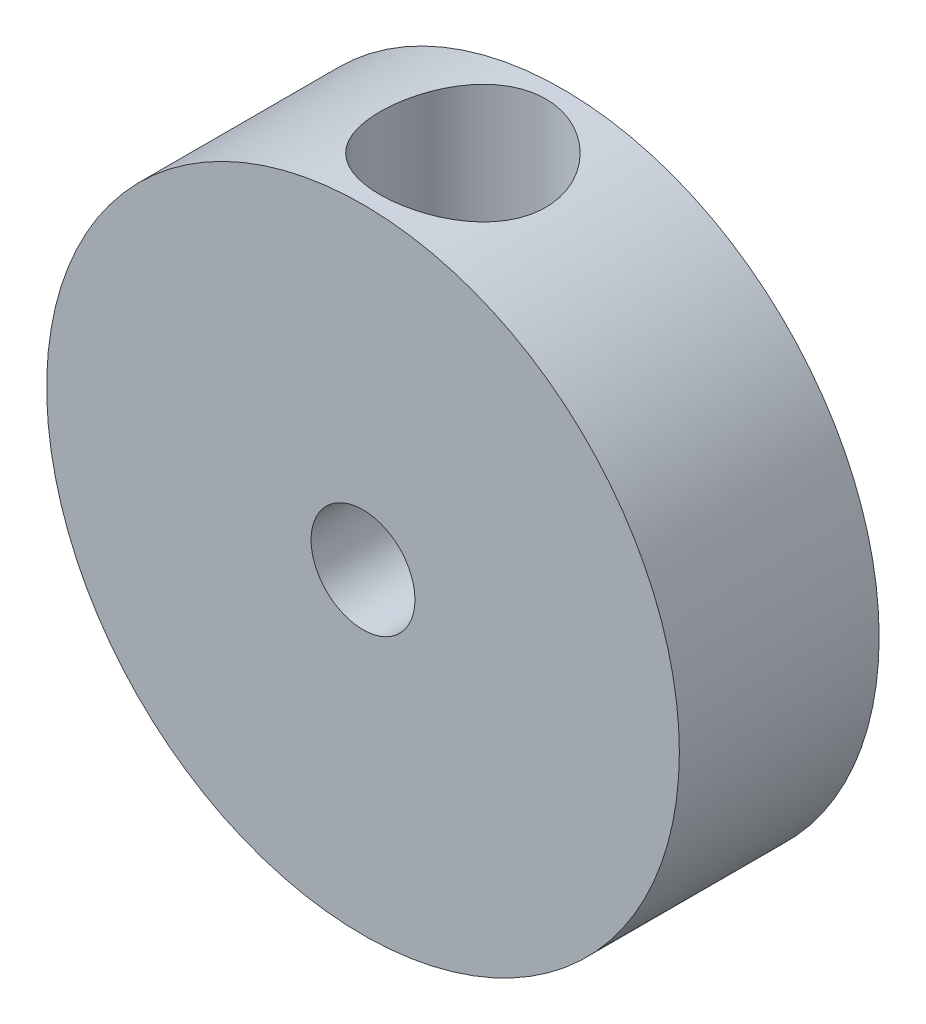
ISO-10303-21;
HEADER;
FILE_DESCRIPTION(('STEP AP214'),'2;1');
FILE_NAME('part.step','',(''),(''),'','','');
FILE_SCHEMA(('AUTOMOTIVE_DESIGN { 1 0 10303 214 1 1 1 1 }'));
ENDSEC;
DATA;
#1=APPLICATION_CONTEXT('core data for automotive mechanical design processes');
#2=APPLICATION_PROTOCOL_DEFINITION('international standard','automotive_design',2000,#1);
#3=PRODUCT_CONTEXT('',#1,'mechanical');
#4=PRODUCT('Part','Part','',(#3));
#5=PRODUCT_RELATED_PRODUCT_CATEGORY('part','',(#4));
#6=PRODUCT_DEFINITION_FORMATION('','',#4);
#7=PRODUCT_DEFINITION_CONTEXT('part definition',#1,'design');
#8=PRODUCT_DEFINITION('design','',#6,#7);
#9=PRODUCT_DEFINITION_SHAPE('','',#8);
#10=(LENGTH_UNIT() NAMED_UNIT(*) SI_UNIT(.MILLI.,.METRE.));
#11=(NAMED_UNIT(*) PLANE_ANGLE_UNIT() SI_UNIT($,.RADIAN.));
#12=(NAMED_UNIT(*) SI_UNIT($,.STERADIAN.) SOLID_ANGLE_UNIT());
#13=UNCERTAINTY_MEASURE_WITH_UNIT(LENGTH_MEASURE(1.E-05),#10,'distance_accuracy_value','');
#14=(GEOMETRIC_REPRESENTATION_CONTEXT(3) GLOBAL_UNCERTAINTY_ASSIGNED_CONTEXT((#13)) GLOBAL_UNIT_ASSIGNED_CONTEXT((#10,
#11,#12)) REPRESENTATION_CONTEXT('',''));
#15=CARTESIAN_POINT('',(0.,0.,0.));
#16=DIRECTION('',(0.,0.,1.));
#17=DIRECTION('',(1.,0.,0.));
#18=AXIS2_PLACEMENT_3D('',#15,#16,#17);
#19=CARTESIAN_POINT('',(0.,0.,-7.62));
#20=DIRECTION('',(0.,0.,1.));
#21=DIRECTION('',(1.,0.,0.));
#22=AXIS2_PLACEMENT_3D('',#19,#20,#21);
#23=CYLINDRICAL_SURFACE('',#22,12.065);
#24=CARTESIAN_POINT('',(0.,-12.065,-0.6477));
#25=CARTESIAN_POINT('',(-0.174438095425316,-12.0649972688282,-0.647704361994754));
#26=CARTESIAN_POINT('',(-0.348923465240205,-12.0611795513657,-0.662181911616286));
#27=CARTESIAN_POINT('',(-0.692874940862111,-12.0463204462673,-0.71961151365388));
#28=CARTESIAN_POINT('',(-0.862338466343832,-12.0352754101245,-0.762577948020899));
#29=CARTESIAN_POINT('',(-1.19123115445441,-12.007181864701,-0.875497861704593));
#30=CARTESIAN_POINT('',(-1.35067271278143,-11.9901409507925,-0.945417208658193));
#31=CARTESIAN_POINT('',(-1.65556558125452,-11.9518604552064,-1.11013344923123));
#32=CARTESIAN_POINT('',(-1.80101608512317,-11.9306206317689,-1.20493177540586));
#33=CARTESIAN_POINT('',(-2.07706563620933,-11.8857055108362,-1.41896379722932));
#34=CARTESIAN_POINT('',(-2.20730557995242,-11.8619897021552,-1.53865216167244));
#35=CARTESIAN_POINT('',(-2.44611306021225,-11.8150581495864,-1.79809438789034));
#36=CARTESIAN_POINT('',(-2.55467790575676,-11.7918424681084,-1.93785073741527));
#37=CARTESIAN_POINT('',(-2.74878696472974,-11.7481270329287,-2.23630629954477));
#38=CARTESIAN_POINT('',(-2.83392125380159,-11.7276784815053,-2.39528030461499));
#39=CARTESIAN_POINT('',(-2.97611339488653,-11.6924068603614,-2.72590746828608));
#40=CARTESIAN_POINT('',(-3.03317622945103,-11.6775827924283,-2.89755837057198));
#41=CARTESIAN_POINT('',(-3.1163646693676,-11.655656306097,-3.24469755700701));
#42=CARTESIAN_POINT('',(-3.14313985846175,-11.6483920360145,-3.42001970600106));
#43=CARTESIAN_POINT('',(-3.16701763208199,-11.6419238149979,-3.77280631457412));
#44=CARTESIAN_POINT('',(-3.16412555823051,-11.6427184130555,-3.95027038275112));
#45=CARTESIAN_POINT('',(-3.12926732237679,-11.6521331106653,-4.29725896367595));
#46=CARTESIAN_POINT('',(-3.09808379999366,-11.6605425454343,-4.46686872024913));
#47=CARTESIAN_POINT('',(-3.00877994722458,-11.6839025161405,-4.79836084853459));
#48=CARTESIAN_POINT('',(-2.95065752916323,-11.6988535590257,-4.96024262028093));
#49=CARTESIAN_POINT('',(-2.80847990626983,-11.7337996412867,-5.27373993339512));
#50=CARTESIAN_POINT('',(-2.7241476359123,-11.7538481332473,-5.42522361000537));
#51=CARTESIAN_POINT('',(-2.53213761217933,-11.7967010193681,-5.71216612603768));
#52=CARTESIAN_POINT('',(-2.42445540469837,-11.8195059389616,-5.84762190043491));
#53=CARTESIAN_POINT('',(-2.1847858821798,-11.866181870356,-6.10313888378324));
#54=CARTESIAN_POINT('',(-2.05214043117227,-11.8900638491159,-6.22258161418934));
#55=CARTESIAN_POINT('',(-1.76841151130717,-11.9355585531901,-6.43765131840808));
#56=CARTESIAN_POINT('',(-1.61732736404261,-11.9571711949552,-6.5332774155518));
#57=CARTESIAN_POINT('',(-1.30007310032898,-11.9958176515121,-6.69825892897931));
#58=CARTESIAN_POINT('',(-1.13384398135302,-12.0128324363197,-6.76750563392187));
#59=CARTESIAN_POINT('',(-0.791556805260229,-12.0402283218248,-6.87689450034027));
#60=CARTESIAN_POINT('',(-0.615500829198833,-12.0506108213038,-6.91704279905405));
#61=CARTESIAN_POINT('',(-0.263838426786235,-12.0633620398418,-6.96613153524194));
#62=CARTESIAN_POINT('',(-0.0883570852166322,-12.0659467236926,-6.97591322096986));
#63=CARTESIAN_POINT('',(0.26173764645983,-12.0634303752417,-6.96630983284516));
#64=CARTESIAN_POINT('',(0.436351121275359,-12.0583301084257,-6.94692766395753));
#65=CARTESIAN_POINT('',(0.776773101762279,-12.0411561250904,-6.88023777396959));
#66=CARTESIAN_POINT('',(0.942679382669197,-12.0291989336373,-6.83339639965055));
#67=CARTESIAN_POINT('',(1.26426541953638,-11.9996648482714,-6.71365681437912));
#68=CARTESIAN_POINT('',(1.41994408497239,-11.9820873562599,-6.64075583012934));
#69=CARTESIAN_POINT('',(1.71994646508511,-11.9427532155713,-6.46938654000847));
#70=CARTESIAN_POINT('',(1.86399673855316,-11.9209232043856,-6.37045679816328));
#71=CARTESIAN_POINT('',(2.13374783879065,-11.8756088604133,-6.15042102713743));
#72=CARTESIAN_POINT('',(2.25944516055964,-11.8521242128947,-6.02931077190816));
#73=CARTESIAN_POINT('',(2.49244553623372,-11.8053576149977,-5.76443118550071));
#74=CARTESIAN_POINT('',(2.59915594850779,-11.7820985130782,-5.62013556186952));
#75=CARTESIAN_POINT('',(2.7868570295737,-11.7391209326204,-5.31519690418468));
#76=CARTESIAN_POINT('',(2.8678487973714,-11.7194023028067,-5.15455456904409));
#77=CARTESIAN_POINT('',(3.00120392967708,-11.6859628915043,-4.82230488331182));
#78=CARTESIAN_POINT('',(3.05373474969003,-11.6722071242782,-4.65076845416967));
#79=CARTESIAN_POINT('',(3.12908699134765,-11.6522353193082,-4.30087732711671));
#80=CARTESIAN_POINT('',(3.1519156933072,-11.6460174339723,-4.12252431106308));
#81=CARTESIAN_POINT('',(3.16680743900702,-11.6419760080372,-3.7701197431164));
#82=CARTESIAN_POINT('',(3.15982147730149,-11.643892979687,-3.59611074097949));
#83=CARTESIAN_POINT('',(3.11747993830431,-11.6552998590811,-3.25184515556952));
#84=CARTESIAN_POINT('',(3.08212504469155,-11.6647895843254,-3.08158848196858));
#85=CARTESIAN_POINT('',(2.98459185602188,-11.6901209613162,-2.75081183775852));
#86=CARTESIAN_POINT('',(2.92260861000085,-11.7059163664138,-2.59023056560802));
#87=CARTESIAN_POINT('',(2.77373027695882,-11.7420819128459,-2.2816267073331));
#88=CARTESIAN_POINT('',(2.68683140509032,-11.7624527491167,-2.13360603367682));
#89=CARTESIAN_POINT('',(2.4876787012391,-11.8061991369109,-1.84976998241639));
#90=CARTESIAN_POINT('',(2.37477283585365,-11.8296437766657,-1.7144226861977));
#91=CARTESIAN_POINT('',(2.12805975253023,-11.8765030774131,-1.46428652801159));
#92=CARTESIAN_POINT('',(1.99424749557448,-11.8999177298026,-1.34950263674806));
#93=CARTESIAN_POINT('',(1.70621711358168,-11.9446512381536,-1.14144875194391));
#94=CARTESIAN_POINT('',(1.55163759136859,-11.9659174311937,-1.04866682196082));
#95=CARTESIAN_POINT('',(1.22852509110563,-12.0033878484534,-0.890553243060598));
#96=CARTESIAN_POINT('',(1.06000145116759,-12.0195954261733,-0.825203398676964));
#97=CARTESIAN_POINT('',(0.743341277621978,-12.0429419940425,-0.732664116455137));
#98=CARTESIAN_POINT('',(0.596611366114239,-12.0511544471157,-0.700875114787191));
#99=CARTESIAN_POINT('',(0.299932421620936,-12.0621843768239,-0.658392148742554));
#100=CARTESIAN_POINT('',(0.149983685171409,-12.0650023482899,-0.647696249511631));
#101=CARTESIAN_POINT('',(0.,-12.065,-0.6477));
#102=B_SPLINE_CURVE_WITH_KNOTS('',3,(#24,#25,#26,#27,#28,#29,#30,#31,#32,#33,#34,#35,#36,#37,
#38,#39,#40,#41,#42,#43,#44,#45,#46,#47,#48,#49,#50,#51,#52,#53,#54,#55,#56,#57,#58,#59,#60,#61,
#62,#63,#64,#65,#66,#67,#68,#69,#70,#71,#72,#73,#74,#75,#76,#77,#78,#79,#80,#81,#82,#83,#84,#85,
#86,#87,#88,#89,#90,#91,#92,#93,#94,#95,#96,#97,#98,#99,#100,#101),.UNSPECIFIED.,.T.,.F.,(4,2,2,
2,2,2,2,2,2,2,2,2,2,2,2,2,2,2,2,2,2,2,2,2,2,2,2,2,2,2,2,2,2,2,2,2,2,2,4),(0.,0.52276436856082,
1.04579284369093,1.56816113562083,2.09055951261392,2.62350414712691,3.15651490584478,
3.69833090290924,4.24005069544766,4.76991775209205,5.29968940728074,5.81523822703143,
6.33082700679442,6.85206295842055,7.37339842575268,7.91113730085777,8.44889596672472,
8.98884739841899,9.52868491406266,10.0534274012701,10.5781176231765,11.0941449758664,
11.6102272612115,12.1361598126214,12.6621926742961,13.2025194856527,13.7428232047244,
14.2799124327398,14.8168699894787,15.3368304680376,15.8567784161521,16.3729810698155,
16.8892621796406,17.4202573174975,17.9513806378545,18.4933674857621,19.034994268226,
19.4845137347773,19.9339919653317),.UNSPECIFIED.);
#103=CARTESIAN_POINT('',(0.,-12.065,-0.6477));
#104=VERTEX_POINT('',#103);
#105=EDGE_CURVE('E50',#104,#104,#102,.T.);
#106=ORIENTED_EDGE('',*,*,#105,.F.);
#107=EDGE_LOOP('',(#106));
#108=FACE_BOUND('',#107,.T.);
#109=CARTESIAN_POINT('',(0.,12.065,-0.6477));
#110=CARTESIAN_POINT('',(0.174438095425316,12.0649972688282,-0.647704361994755));
#111=CARTESIAN_POINT('',(0.348923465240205,12.0611795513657,-0.662181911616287));
#112=CARTESIAN_POINT('',(0.692874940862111,12.0463204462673,-0.719611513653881));
#113=CARTESIAN_POINT('',(0.862338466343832,12.0352754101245,-0.762577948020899));
#114=CARTESIAN_POINT('',(1.19123115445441,12.007181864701,-0.875497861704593));
#115=CARTESIAN_POINT('',(1.35067271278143,11.9901409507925,-0.945417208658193));
#116=CARTESIAN_POINT('',(1.65556558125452,11.9518604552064,-1.11013344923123));
#117=CARTESIAN_POINT('',(1.80101608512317,11.9306206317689,-1.20493177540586));
#118=CARTESIAN_POINT('',(2.07706563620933,11.8857055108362,-1.41896379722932));
#119=CARTESIAN_POINT('',(2.20730557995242,11.8619897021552,-1.53865216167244));
#120=CARTESIAN_POINT('',(2.44611306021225,11.8150581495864,-1.79809438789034));
#121=CARTESIAN_POINT('',(2.55467790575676,11.7918424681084,-1.93785073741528));
#122=CARTESIAN_POINT('',(2.74878696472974,11.7481270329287,-2.23630629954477));
#123=CARTESIAN_POINT('',(2.83392125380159,11.7276784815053,-2.39528030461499));
#124=CARTESIAN_POINT('',(2.97611339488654,11.6924068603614,-2.72590746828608));
#125=CARTESIAN_POINT('',(3.03317622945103,11.6775827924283,-2.89755837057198));
#126=CARTESIAN_POINT('',(3.1163646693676,11.655656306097,-3.24469755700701));
#127=CARTESIAN_POINT('',(3.14313985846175,11.6483920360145,-3.42001970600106));
#128=CARTESIAN_POINT('',(3.16701763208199,11.6419238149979,-3.77280631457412));
#129=CARTESIAN_POINT('',(3.16412555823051,11.6427184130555,-3.95027038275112));
#130=CARTESIAN_POINT('',(3.12926732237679,11.6521331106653,-4.29725896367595));
#131=CARTESIAN_POINT('',(3.09808379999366,11.6605425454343,-4.46686872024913));
#132=CARTESIAN_POINT('',(3.00877994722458,11.6839025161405,-4.79836084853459));
#133=CARTESIAN_POINT('',(2.95065752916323,11.6988535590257,-4.96024262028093));
#134=CARTESIAN_POINT('',(2.80847990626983,11.7337996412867,-5.27373993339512));
#135=CARTESIAN_POINT('',(2.7241476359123,11.7538481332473,-5.42522361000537));
#136=CARTESIAN_POINT('',(2.53213761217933,11.7967010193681,-5.71216612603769));
#137=CARTESIAN_POINT('',(2.42445540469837,11.8195059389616,-5.84762190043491));
#138=CARTESIAN_POINT('',(2.1847858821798,11.866181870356,-6.10313888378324));
#139=CARTESIAN_POINT('',(2.05214043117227,11.8900638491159,-6.22258161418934));
#140=CARTESIAN_POINT('',(1.76841151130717,11.9355585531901,-6.43765131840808));
#141=CARTESIAN_POINT('',(1.61732736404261,11.9571711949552,-6.5332774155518));
#142=CARTESIAN_POINT('',(1.30007310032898,11.9958176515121,-6.69825892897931));
#143=CARTESIAN_POINT('',(1.13384398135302,12.0128324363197,-6.76750563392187));
#144=CARTESIAN_POINT('',(0.791556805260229,12.0402283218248,-6.87689450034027));
#145=CARTESIAN_POINT('',(0.615500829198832,12.0506108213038,-6.91704279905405));
#146=CARTESIAN_POINT('',(0.263838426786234,12.0633620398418,-6.96613153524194));
#147=CARTESIAN_POINT('',(0.0883570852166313,12.0659467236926,-6.97591322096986));
#148=CARTESIAN_POINT('',(-0.261737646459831,12.0634303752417,-6.96630983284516));
#149=CARTESIAN_POINT('',(-0.436351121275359,12.0583301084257,-6.94692766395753));
#150=CARTESIAN_POINT('',(-0.776773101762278,12.0411561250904,-6.88023777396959));
#151=CARTESIAN_POINT('',(-0.942679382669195,12.0291989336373,-6.83339639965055));
#152=CARTESIAN_POINT('',(-1.26426541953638,11.9996648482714,-6.71365681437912));
#153=CARTESIAN_POINT('',(-1.41994408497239,11.9820873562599,-6.64075583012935));
#154=CARTESIAN_POINT('',(-1.71994646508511,11.9427532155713,-6.46938654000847));
#155=CARTESIAN_POINT('',(-1.86399673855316,11.9209232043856,-6.37045679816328));
#156=CARTESIAN_POINT('',(-2.13374783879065,11.8756088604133,-6.15042102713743));
#157=CARTESIAN_POINT('',(-2.25944516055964,11.8521242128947,-6.02931077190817));
#158=CARTESIAN_POINT('',(-2.49244553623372,11.8053576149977,-5.76443118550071));
#159=CARTESIAN_POINT('',(-2.59915594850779,11.7820985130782,-5.62013556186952));
#160=CARTESIAN_POINT('',(-2.7868570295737,11.7391209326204,-5.31519690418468));
#161=CARTESIAN_POINT('',(-2.8678487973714,11.7194023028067,-5.15455456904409));
#162=CARTESIAN_POINT('',(-3.00120392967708,11.6859628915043,-4.82230488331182));
#163=CARTESIAN_POINT('',(-3.05373474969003,11.6722071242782,-4.65076845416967));
#164=CARTESIAN_POINT('',(-3.12908699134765,11.6522353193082,-4.30087732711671));
#165=CARTESIAN_POINT('',(-3.1519156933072,11.6460174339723,-4.12252431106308));
#166=CARTESIAN_POINT('',(-3.16680743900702,11.6419760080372,-3.7701197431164));
#167=CARTESIAN_POINT('',(-3.15982147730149,11.643892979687,-3.59611074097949));
#168=CARTESIAN_POINT('',(-3.11747993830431,11.6552998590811,-3.25184515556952));
#169=CARTESIAN_POINT('',(-3.08212504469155,11.6647895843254,-3.08158848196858));
#170=CARTESIAN_POINT('',(-2.98459185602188,11.6901209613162,-2.75081183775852));
#171=CARTESIAN_POINT('',(-2.92260861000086,11.7059163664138,-2.59023056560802));
#172=CARTESIAN_POINT('',(-2.77373027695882,11.7420819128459,-2.2816267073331));
#173=CARTESIAN_POINT('',(-2.68683140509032,11.7624527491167,-2.13360603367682));
#174=CARTESIAN_POINT('',(-2.4876787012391,11.8061991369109,-1.84976998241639));
#175=CARTESIAN_POINT('',(-2.37477283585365,11.8296437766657,-1.7144226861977));
#176=CARTESIAN_POINT('',(-2.12805975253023,11.8765030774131,-1.46428652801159));
#177=CARTESIAN_POINT('',(-1.99424749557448,11.8999177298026,-1.34950263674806));
#178=CARTESIAN_POINT('',(-1.70621711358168,11.9446512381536,-1.14144875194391));
#179=CARTESIAN_POINT('',(-1.55163759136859,11.9659174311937,-1.04866682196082));
#180=CARTESIAN_POINT('',(-1.22852509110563,12.0033878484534,-0.890553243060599));
#181=CARTESIAN_POINT('',(-1.06000145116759,12.0195954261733,-0.825203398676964));
#182=CARTESIAN_POINT('',(-0.743341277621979,12.0429419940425,-0.732664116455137));
#183=CARTESIAN_POINT('',(-0.59661136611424,12.0511544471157,-0.700875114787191));
#184=CARTESIAN_POINT('',(-0.299932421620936,12.0621843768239,-0.658392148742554));
#185=CARTESIAN_POINT('',(-0.149983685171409,12.0650023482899,-0.647696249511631));
#186=CARTESIAN_POINT('',(0.,12.065,-0.6477));
#187=B_SPLINE_CURVE_WITH_KNOTS('',3,(#109,#110,#111,#112,#113,#114,#115,#116,#117,#118,#119,
#120,#121,#122,#123,#124,#125,#126,#127,#128,#129,#130,#131,#132,#133,#134,#135,#136,#137,#138,
#139,#140,#141,#142,#143,#144,#145,#146,#147,#148,#149,#150,#151,#152,#153,#154,#155,#156,#157,
#158,#159,#160,#161,#162,#163,#164,#165,#166,#167,#168,#169,#170,#171,#172,#173,#174,#175,#176,
#177,#178,#179,#180,#181,#182,#183,#184,#185,#186),.UNSPECIFIED.,.T.,.F.,(4,2,2,2,2,2,2,2,2,2,2,
2,2,2,2,2,2,2,2,2,2,2,2,2,2,2,2,2,2,2,2,2,2,2,2,2,2,2,4),(0.,0.52276436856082,1.04579284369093,
1.56816113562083,2.09055951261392,2.62350414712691,3.15651490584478,3.69833090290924,
4.24005069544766,4.76991775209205,5.29968940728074,5.81523822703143,6.33082700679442,
6.85206295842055,7.37339842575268,7.91113730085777,8.44889596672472,8.98884739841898,
9.52868491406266,10.0534274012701,10.5781176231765,11.0941449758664,11.6102272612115,
12.1361598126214,12.6621926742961,13.2025194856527,13.7428232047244,14.2799124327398,
14.8168699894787,15.3368304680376,15.8567784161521,16.3729810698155,16.8892621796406,
17.4202573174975,17.9513806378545,18.4933674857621,19.034994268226,19.4845137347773,
19.9339919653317),.UNSPECIFIED.);
#188=CARTESIAN_POINT('',(0.,12.065,-0.6477));
#189=VERTEX_POINT('',#188);
#190=EDGE_CURVE('E10',#189,#189,#187,.T.);
#191=ORIENTED_EDGE('',*,*,#190,.F.);
#192=EDGE_LOOP('',(#191));
#193=FACE_BOUND('',#192,.T.);
#194=CARTESIAN_POINT('',(0.,0.,-7.62));
#195=DIRECTION('',(0.,0.,1.));
#196=DIRECTION('',(1.,0.,0.));
#197=AXIS2_PLACEMENT_3D('',#194,#195,#196);
#198=CIRCLE('',#197,12.065);
#199=CARTESIAN_POINT('',(12.065,0.,-7.62));
#200=VERTEX_POINT('',#199);
#201=EDGE_CURVE('E38',#200,#200,#198,.T.);
#202=ORIENTED_EDGE('',*,*,#201,.T.);
#203=EDGE_LOOP('',(#202));
#204=FACE_BOUND('',#203,.T.);
#205=CARTESIAN_POINT('',(0.,0.,0.));
#206=DIRECTION('',(0.,0.,1.));
#207=DIRECTION('',(1.,0.,0.));
#208=AXIS2_PLACEMENT_3D('',#205,#206,#207);
#209=CIRCLE('',#208,12.065);
#210=CARTESIAN_POINT('',(12.065,0.,0.));
#211=VERTEX_POINT('',#210);
#212=EDGE_CURVE('E43',#211,#211,#209,.T.);
#213=ORIENTED_EDGE('',*,*,#212,.F.);
#214=EDGE_LOOP('',(#213));
#215=FACE_BOUND('',#214,.T.);
#216=ADVANCED_FACE('F26',(#108,#193,#204,#215),#23,.T.);
#217=CARTESIAN_POINT('',(0.,0.,-7.62));
#218=DIRECTION('',(0.,0.,1.));
#219=DIRECTION('',(1.,0.,0.));
#220=AXIS2_PLACEMENT_3D('',#217,#218,#219);
#221=PLANE('',#220);
#222=CARTESIAN_POINT('',(0.,0.,-7.62));
#223=DIRECTION('',(0.,0.,1.));
#224=DIRECTION('',(1.,0.,0.));
#225=AXIS2_PLACEMENT_3D('',#222,#223,#224);
#226=CIRCLE('',#225,1.9812);
#227=CARTESIAN_POINT('',(1.9812,0.,-7.62));
#228=VERTEX_POINT('',#227);
#229=EDGE_CURVE('E73',#228,#228,#226,.T.);
#230=ORIENTED_EDGE('',*,*,#229,.T.);
#231=EDGE_LOOP('',(#230));
#232=FACE_BOUND('',#231,.T.);
#233=ORIENTED_EDGE('',*,*,#201,.F.);
#234=EDGE_LOOP('',(#233));
#235=FACE_BOUND('',#234,.T.);
#236=ADVANCED_FACE('F62',(#232,#235),#221,.F.);
#237=CARTESIAN_POINT('',(0.,0.,0.));
#238=DIRECTION('',(0.,0.,1.));
#239=DIRECTION('',(1.,0.,0.));
#240=AXIS2_PLACEMENT_3D('',#237,#238,#239);
#241=PLANE('',#240);
#242=CARTESIAN_POINT('',(0.,0.,0.));
#243=DIRECTION('',(0.,0.,1.));
#244=DIRECTION('',(1.,0.,0.));
#245=AXIS2_PLACEMENT_3D('',#242,#243,#244);
#246=CIRCLE('',#245,1.9812);
#247=CARTESIAN_POINT('',(1.9812,0.,0.));
#248=VERTEX_POINT('',#247);
#249=EDGE_CURVE('E88',#248,#248,#246,.T.);
#250=ORIENTED_EDGE('',*,*,#249,.F.);
#251=EDGE_LOOP('',(#250));
#252=FACE_BOUND('',#251,.T.);
#253=ORIENTED_EDGE('',*,*,#212,.T.);
#254=EDGE_LOOP('',(#253));
#255=FACE_BOUND('',#254,.T.);
#256=ADVANCED_FACE('F60',(#252,#255),#241,.T.);
#257=CARTESIAN_POINT('',(0.,4.445,-3.81));
#258=DIRECTION('',(0.,1.,0.));
#259=DIRECTION('',(0.,0.,1.));
#260=AXIS2_PLACEMENT_3D('',#257,#258,#259);
#261=CYLINDRICAL_SURFACE('',#260,3.1623);
#262=ORIENTED_EDGE('',*,*,#190,.T.);
#263=EDGE_LOOP('',(#262));
#264=FACE_BOUND('',#263,.T.);
#265=CARTESIAN_POINT('',(0.,4.445,-3.81));
#266=DIRECTION('',(0.,1.,0.));
#267=DIRECTION('',(0.,0.,1.));
#268=AXIS2_PLACEMENT_3D('',#265,#266,#267);
#269=CIRCLE('',#268,3.1623);
#270=CARTESIAN_POINT('',(0.,4.445,-0.6477));
#271=VERTEX_POINT('',#270);
#272=EDGE_CURVE('E80',#271,#271,#269,.T.);
#273=ORIENTED_EDGE('',*,*,#272,.F.);
#274=EDGE_LOOP('',(#273));
#275=FACE_BOUND('',#274,.T.);
#276=ADVANCED_FACE('F54',(#264,#275),#261,.F.);
#277=CARTESIAN_POINT('',(0.,4.445,-3.81));
#278=DIRECTION('',(0.,1.,0.));
#279=DIRECTION('',(0.,0.,1.));
#280=AXIS2_PLACEMENT_3D('',#277,#278,#279);
#281=PLANE('',#280);
#282=CARTESIAN_POINT('',(0.,4.445,-3.81));
#283=DIRECTION('',(0.,1.,0.));
#284=DIRECTION('',(0.,0.,1.));
#285=AXIS2_PLACEMENT_3D('',#282,#283,#284);
#286=CIRCLE('',#285,0.4445);
#287=CARTESIAN_POINT('',(0.,4.445,-3.3655));
#288=VERTEX_POINT('',#287);
#289=EDGE_CURVE('E94',#288,#288,#286,.T.);
#290=ORIENTED_EDGE('',*,*,#289,.F.);
#291=EDGE_LOOP('',(#290));
#292=FACE_BOUND('',#291,.T.);
#293=ORIENTED_EDGE('',*,*,#272,.T.);
#294=EDGE_LOOP('',(#293));
#295=FACE_BOUND('',#294,.T.);
#296=ADVANCED_FACE('F59',(#292,#295),#281,.T.);
#297=CARTESIAN_POINT('',(0.,-19.685,-3.81));
#298=DIRECTION('',(0.,1.,0.));
#299=DIRECTION('',(0.,0.,1.));
#300=AXIS2_PLACEMENT_3D('',#297,#298,#299);
#301=CYLINDRICAL_SURFACE('',#300,3.1623);
#302=ORIENTED_EDGE('',*,*,#105,.T.);
#303=EDGE_LOOP('',(#302));
#304=FACE_BOUND('',#303,.T.);
#305=CARTESIAN_POINT('',(0.,-4.445,-3.81));
#306=DIRECTION('',(0.,1.,0.));
#307=DIRECTION('',(0.,0.,1.));
#308=AXIS2_PLACEMENT_3D('',#305,#306,#307);
#309=CIRCLE('',#308,3.1623);
#310=CARTESIAN_POINT('',(0.,-4.445,-0.6477));
#311=VERTEX_POINT('',#310);
#312=EDGE_CURVE('E84',#311,#311,#309,.T.);
#313=ORIENTED_EDGE('',*,*,#312,.T.);
#314=EDGE_LOOP('',(#313));
#315=FACE_BOUND('',#314,.T.);
#316=ADVANCED_FACE('F124',(#304,#315),#301,.F.);
#317=CARTESIAN_POINT('',(0.,-4.445,-3.81));
#318=DIRECTION('',(0.,1.,0.));
#319=DIRECTION('',(0.,0.,1.));
#320=AXIS2_PLACEMENT_3D('',#317,#318,#319);
#321=PLANE('',#320);
#322=CARTESIAN_POINT('',(0.,-4.445,-3.81));
#323=DIRECTION('',(0.,1.,0.));
#324=DIRECTION('',(0.,0.,1.));
#325=AXIS2_PLACEMENT_3D('',#322,#323,#324);
#326=CIRCLE('',#325,0.4445);
#327=CARTESIAN_POINT('',(0.,-4.445,-3.3655));
#328=VERTEX_POINT('',#327);
#329=EDGE_CURVE('E91',#328,#328,#326,.T.);
#330=ORIENTED_EDGE('',*,*,#329,.T.);
#331=EDGE_LOOP('',(#330));
#332=FACE_BOUND('',#331,.T.);
#333=ORIENTED_EDGE('',*,*,#312,.F.);
#334=EDGE_LOOP('',(#333));
#335=FACE_BOUND('',#334,.T.);
#336=ADVANCED_FACE('F121',(#332,#335),#321,.F.);
#337=CARTESIAN_POINT('',(0.,0.,-7.62));
#338=DIRECTION('',(0.,0.,1.));
#339=DIRECTION('',(1.,0.,0.));
#340=AXIS2_PLACEMENT_3D('',#337,#338,#339);
#341=CYLINDRICAL_SURFACE('',#340,1.9812);
#342=CARTESIAN_POINT('',(0.,-1.9812,-3.3655));
#343=CARTESIAN_POINT('',(-0.0246370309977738,-1.9811995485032,-3.36550081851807));
#344=CARTESIAN_POINT('',(-0.0492838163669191,-1.98073578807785,-3.36755522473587));
#345=CARTESIAN_POINT('',(-0.0978762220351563,-1.97893057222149,-3.37570939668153));
#346=CARTESIAN_POINT('',(-0.121821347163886,-1.97758851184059,-3.38181195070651));
#347=CARTESIAN_POINT('',(-0.168301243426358,-1.97417598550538,-3.3978608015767));
#348=CARTESIAN_POINT('',(-0.190837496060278,-1.97210630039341,-3.40780297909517));
#349=CARTESIAN_POINT('',(-0.233921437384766,-1.96746139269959,-3.43123553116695));
#350=CARTESIAN_POINT('',(-0.254469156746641,-1.96488617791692,-3.44472585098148));
#351=CARTESIAN_POINT('',(-0.293339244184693,-1.95946342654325,-3.47511195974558));
#352=CARTESIAN_POINT('',(-0.311623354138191,-1.95661236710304,-3.49205606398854));
#353=CARTESIAN_POINT('',(-0.345115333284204,-1.95098383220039,-3.52876508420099));
#354=CARTESIAN_POINT('',(-0.360322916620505,-1.94820636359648,-3.54853026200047));
#355=CARTESIAN_POINT('',(-0.387400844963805,-1.94300462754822,-3.59060566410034));
#356=CARTESIAN_POINT('',(-0.399230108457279,-1.94058486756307,-3.61294293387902));
#357=CARTESIAN_POINT('',(-0.418951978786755,-1.93642323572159,-3.65935162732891));
#358=CARTESIAN_POINT('',(-0.426845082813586,-1.93468127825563,-3.68342283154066));
#359=CARTESIAN_POINT('',(-0.438343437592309,-1.93210842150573,-3.73220007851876));
#360=CARTESIAN_POINT('',(-0.442016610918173,-1.93126310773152,-3.75688933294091));
#361=CARTESIAN_POINT('',(-0.445182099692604,-1.93053598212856,-3.80654700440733));
#362=CARTESIAN_POINT('',(-0.444674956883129,-1.93065404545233,-3.83151538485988));
#363=CARTESIAN_POINT('',(-0.439548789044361,-1.93182730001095,-3.88051498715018));
#364=CARTESIAN_POINT('',(-0.43500900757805,-1.93286443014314,-3.90455499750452));
#365=CARTESIAN_POINT('',(-0.422072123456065,-1.9357303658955,-3.95152324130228));
#366=CARTESIAN_POINT('',(-0.413674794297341,-1.93755921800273,-3.97445140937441));
#367=CARTESIAN_POINT('',(-0.39318932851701,-1.94182011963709,-4.01876612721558));
#368=CARTESIAN_POINT('',(-0.381071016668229,-1.94425706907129,-4.04013823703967));
#369=CARTESIAN_POINT('',(-0.353508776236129,-1.94945661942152,-4.08057478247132));
#370=CARTESIAN_POINT('',(-0.338064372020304,-1.9522192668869,-4.09963888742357));
#371=CARTESIAN_POINT('',(-0.303870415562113,-1.95783618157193,-4.1353741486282));
#372=CARTESIAN_POINT('',(-0.285053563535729,-1.96069110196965,-4.15198087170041));
#373=CARTESIAN_POINT('',(-0.244869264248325,-1.9661136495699,-4.18181377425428));
#374=CARTESIAN_POINT('',(-0.223501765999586,-1.96868127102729,-4.19503988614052));
#375=CARTESIAN_POINT('',(-0.178741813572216,-1.97324894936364,-4.21775334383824));
#376=CARTESIAN_POINT('',(-0.155344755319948,-1.97524766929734,-4.22723190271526));
#377=CARTESIAN_POINT('',(-0.10723507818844,-1.97844245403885,-4.24210479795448));
#378=CARTESIAN_POINT('',(-0.0825226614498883,-1.97963864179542,-4.24749975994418));
#379=CARTESIAN_POINT('',(-0.0330361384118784,-1.98107596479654,-4.25395780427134));
#380=CARTESIAN_POINT('',(-0.00827405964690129,-1.98133649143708,-4.25510885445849));
#381=CARTESIAN_POINT('',(0.0410885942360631,-1.98092762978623,-4.25328531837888));
#382=CARTESIAN_POINT('',(0.0656891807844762,-1.98025830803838,-4.25031102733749));
#383=CARTESIAN_POINT('',(0.113736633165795,-1.97807722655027,-4.24039412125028));
#384=CARTESIAN_POINT('',(0.137193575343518,-1.97657533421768,-4.23349796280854));
#385=CARTESIAN_POINT('',(0.182617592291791,-1.97289736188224,-4.2159848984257));
#386=CARTESIAN_POINT('',(0.204584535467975,-1.97072122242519,-4.20536766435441));
#387=CARTESIAN_POINT('',(0.246766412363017,-1.96588851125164,-4.18053275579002));
#388=CARTESIAN_POINT('',(0.266950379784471,-1.96322526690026,-4.16626381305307));
#389=CARTESIAN_POINT('',(0.304668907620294,-1.95772680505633,-4.13459769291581));
#390=CARTESIAN_POINT('',(0.322203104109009,-1.95489156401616,-4.11720008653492));
#391=CARTESIAN_POINT('',(0.354474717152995,-1.94930118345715,-4.07936591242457));
#392=CARTESIAN_POINT('',(0.369151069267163,-1.9465486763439,-4.05887679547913));
#393=CARTESIAN_POINT('',(0.394855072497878,-1.94149818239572,-4.0156731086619));
#394=CARTESIAN_POINT('',(0.405882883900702,-1.93920017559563,-3.9929586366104));
#395=CARTESIAN_POINT('',(0.423900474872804,-1.9353415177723,-3.94607208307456));
#396=CARTESIAN_POINT('',(0.430913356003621,-1.93377665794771,-3.92190924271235));
#397=CARTESIAN_POINT('',(0.440768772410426,-1.93155437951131,-3.87270824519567));
#398=CARTESIAN_POINT('',(0.443612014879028,-1.93089680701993,-3.84767023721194));
#399=CARTESIAN_POINT('',(0.445016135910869,-1.93057360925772,-3.79804623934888));
#400=CARTESIAN_POINT('',(0.443673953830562,-1.93088552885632,-3.77346308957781));
#401=CARTESIAN_POINT('',(0.4369629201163,-1.93241519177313,-3.7248829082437));
#402=CARTESIAN_POINT('',(0.431594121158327,-1.93363292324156,-3.70088586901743));
#403=CARTESIAN_POINT('',(0.417030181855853,-1.93682577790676,-3.65424095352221));
#404=CARTESIAN_POINT('',(0.40784984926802,-1.93879796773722,-3.63158823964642));
#405=CARTESIAN_POINT('',(0.38593590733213,-1.94327852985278,-3.5881303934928));
#406=CARTESIAN_POINT('',(0.373201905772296,-1.9457869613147,-3.56732546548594));
#407=CARTESIAN_POINT('',(0.344223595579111,-1.95112392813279,-3.5276774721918));
#408=CARTESIAN_POINT('',(0.327910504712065,-1.95395812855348,-3.50888543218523));
#409=CARTESIAN_POINT('',(0.292375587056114,-1.95958999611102,-3.47427379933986));
#410=CARTESIAN_POINT('',(0.273153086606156,-1.96238765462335,-3.45845489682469));
#411=CARTESIAN_POINT('',(0.232025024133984,-1.96767709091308,-3.43002873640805));
#412=CARTESIAN_POINT('',(0.210086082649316,-1.97016411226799,-3.41746883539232));
#413=CARTESIAN_POINT('',(0.164356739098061,-1.97450397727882,-3.39623495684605));
#414=CARTESIAN_POINT('',(0.140567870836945,-1.97635733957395,-3.38755779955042));
#415=CARTESIAN_POINT('',(0.0973046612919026,-1.9788998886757,-3.37583878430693));
#416=CARTESIAN_POINT('',(0.0780600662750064,-1.97975699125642,-3.37196929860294));
#417=CARTESIAN_POINT('',(0.0392123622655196,-1.98090721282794,-3.36679964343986));
#418=CARTESIAN_POINT('',(0.0196092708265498,-1.98120035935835,-3.36549934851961));
#419=CARTESIAN_POINT('',(0.,-1.9812,-3.3655));
#420=B_SPLINE_CURVE_WITH_KNOTS('',3,(#342,#343,#344,#345,#346,#347,#348,#349,#350,#351,#352,
#353,#354,#355,#356,#357,#358,#359,#360,#361,#362,#363,#364,#365,#366,#367,#368,#369,#370,#371,
#372,#373,#374,#375,#376,#377,#378,#379,#380,#381,#382,#383,#384,#385,#386,#387,#388,#389,#390,
#391,#392,#393,#394,#395,#396,#397,#398,#399,#400,#401,#402,#403,#404,#405,#406,#407,#408,#409,
#410,#411,#412,#413,#414,#415,#416,#417,#418,#419),.UNSPECIFIED.,.T.,.F.,(4,2,2,2,2,2,2,2,2,2,2,
2,2,2,2,2,2,2,2,2,2,2,2,2,2,2,2,2,2,2,2,2,2,2,2,2,2,2,4),(0.,0.0738393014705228,
0.147729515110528,0.221540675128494,0.295350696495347,0.370274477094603,0.445205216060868,
0.521011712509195,0.596808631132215,0.671367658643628,0.745917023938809,0.819033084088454,
0.892153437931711,0.965883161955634,1.03962343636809,1.11504416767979,1.19046640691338,
1.266064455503,1.34165091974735,1.41566152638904,1.48966683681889,1.56281324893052,
1.63596611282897,1.71020848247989,1.78446103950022,1.86015853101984,1.93585269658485,
2.0111068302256,2.08634819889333,2.15985993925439,2.23337071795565,2.30659854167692,
2.37983445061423,2.45462510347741,2.52943310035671,2.60527393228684,2.68105254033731,
2.73982608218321,2.79859675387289),.UNSPECIFIED.);
#421=CARTESIAN_POINT('',(0.,-1.9812,-3.3655));
#422=VERTEX_POINT('',#421);
#423=EDGE_CURVE('E30',#422,#422,#420,.T.);
#424=ORIENTED_EDGE('',*,*,#423,.T.);
#425=EDGE_LOOP('',(#424));
#426=FACE_BOUND('',#425,.T.);
#427=CARTESIAN_POINT('',(0.,1.9812,-3.3655));
#428=CARTESIAN_POINT('',(0.0246370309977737,1.98119954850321,-3.36550081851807));
#429=CARTESIAN_POINT('',(0.0492838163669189,1.98073578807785,-3.36755522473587));
#430=CARTESIAN_POINT('',(0.097876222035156,1.97893057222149,-3.37570939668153));
#431=CARTESIAN_POINT('',(0.121821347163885,1.97758851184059,-3.38181195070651));
#432=CARTESIAN_POINT('',(0.168301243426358,1.97417598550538,-3.3978608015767));
#433=CARTESIAN_POINT('',(0.190837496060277,1.97210630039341,-3.40780297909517));
#434=CARTESIAN_POINT('',(0.233921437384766,1.96746139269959,-3.43123553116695));
#435=CARTESIAN_POINT('',(0.254469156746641,1.96488617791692,-3.44472585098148));
#436=CARTESIAN_POINT('',(0.293339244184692,1.95946342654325,-3.47511195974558));
#437=CARTESIAN_POINT('',(0.311623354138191,1.95661236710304,-3.49205606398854));
#438=CARTESIAN_POINT('',(0.345115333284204,1.95098383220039,-3.52876508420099));
#439=CARTESIAN_POINT('',(0.360322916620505,1.94820636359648,-3.54853026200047));
#440=CARTESIAN_POINT('',(0.387400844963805,1.94300462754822,-3.59060566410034));
#441=CARTESIAN_POINT('',(0.399230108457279,1.94058486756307,-3.61294293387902));
#442=CARTESIAN_POINT('',(0.418951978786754,1.93642323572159,-3.65935162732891));
#443=CARTESIAN_POINT('',(0.426845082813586,1.93468127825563,-3.68342283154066));
#444=CARTESIAN_POINT('',(0.438343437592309,1.93210842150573,-3.73220007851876));
#445=CARTESIAN_POINT('',(0.442016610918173,1.93126310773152,-3.75688933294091));
#446=CARTESIAN_POINT('',(0.445182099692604,1.93053598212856,-3.80654700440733));
#447=CARTESIAN_POINT('',(0.444674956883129,1.93065404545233,-3.83151538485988));
#448=CARTESIAN_POINT('',(0.439548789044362,1.93182730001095,-3.88051498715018));
#449=CARTESIAN_POINT('',(0.43500900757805,1.93286443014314,-3.90455499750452));
#450=CARTESIAN_POINT('',(0.422072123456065,1.9357303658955,-3.95152324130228));
#451=CARTESIAN_POINT('',(0.413674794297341,1.93755921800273,-3.97445140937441));
#452=CARTESIAN_POINT('',(0.39318932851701,1.94182011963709,-4.01876612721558));
#453=CARTESIAN_POINT('',(0.381071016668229,1.94425706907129,-4.04013823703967));
#454=CARTESIAN_POINT('',(0.353508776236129,1.94945661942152,-4.08057478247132));
#455=CARTESIAN_POINT('',(0.338064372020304,1.9522192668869,-4.09963888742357));
#456=CARTESIAN_POINT('',(0.303870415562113,1.95783618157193,-4.1353741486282));
#457=CARTESIAN_POINT('',(0.285053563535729,1.96069110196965,-4.15198087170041));
#458=CARTESIAN_POINT('',(0.244869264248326,1.9661136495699,-4.18181377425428));
#459=CARTESIAN_POINT('',(0.223501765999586,1.96868127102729,-4.19503988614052));
#460=CARTESIAN_POINT('',(0.178741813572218,1.97324894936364,-4.21775334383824));
#461=CARTESIAN_POINT('',(0.15534475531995,1.97524766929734,-4.22723190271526));
#462=CARTESIAN_POINT('',(0.107235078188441,1.97844245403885,-4.24210479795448));
#463=CARTESIAN_POINT('',(0.0825226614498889,1.97963864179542,-4.24749975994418));
#464=CARTESIAN_POINT('',(0.0330361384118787,1.98107596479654,-4.25395780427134));
#465=CARTESIAN_POINT('',(0.00827405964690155,1.98133649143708,-4.25510885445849));
#466=CARTESIAN_POINT('',(-0.0410885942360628,1.98092762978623,-4.25328531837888));
#467=CARTESIAN_POINT('',(-0.0656891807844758,1.98025830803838,-4.25031102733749));
#468=CARTESIAN_POINT('',(-0.113736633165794,1.97807722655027,-4.24039412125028));
#469=CARTESIAN_POINT('',(-0.137193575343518,1.97657533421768,-4.23349796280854));
#470=CARTESIAN_POINT('',(-0.18261759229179,1.97289736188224,-4.2159848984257));
#471=CARTESIAN_POINT('',(-0.204584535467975,1.97072122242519,-4.20536766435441));
#472=CARTESIAN_POINT('',(-0.246766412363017,1.96588851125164,-4.18053275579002));
#473=CARTESIAN_POINT('',(-0.266950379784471,1.96322526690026,-4.16626381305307));
#474=CARTESIAN_POINT('',(-0.304668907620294,1.95772680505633,-4.13459769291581));
#475=CARTESIAN_POINT('',(-0.322203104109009,1.95489156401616,-4.11720008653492));
#476=CARTESIAN_POINT('',(-0.354474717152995,1.94930118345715,-4.07936591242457));
#477=CARTESIAN_POINT('',(-0.369151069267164,1.9465486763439,-4.05887679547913));
#478=CARTESIAN_POINT('',(-0.394855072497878,1.94149818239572,-4.0156731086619));
#479=CARTESIAN_POINT('',(-0.405882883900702,1.93920017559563,-3.9929586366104));
#480=CARTESIAN_POINT('',(-0.423900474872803,1.9353415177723,-3.94607208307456));
#481=CARTESIAN_POINT('',(-0.430913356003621,1.93377665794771,-3.92190924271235));
#482=CARTESIAN_POINT('',(-0.440768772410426,1.93155437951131,-3.87270824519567));
#483=CARTESIAN_POINT('',(-0.443612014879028,1.93089680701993,-3.84767023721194));
#484=CARTESIAN_POINT('',(-0.445016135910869,1.93057360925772,-3.79804623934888));
#485=CARTESIAN_POINT('',(-0.443673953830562,1.93088552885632,-3.77346308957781));
#486=CARTESIAN_POINT('',(-0.4369629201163,1.93241519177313,-3.7248829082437));
#487=CARTESIAN_POINT('',(-0.431594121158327,1.93363292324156,-3.70088586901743));
#488=CARTESIAN_POINT('',(-0.417030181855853,1.93682577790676,-3.65424095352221));
#489=CARTESIAN_POINT('',(-0.40784984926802,1.93879796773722,-3.63158823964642));
#490=CARTESIAN_POINT('',(-0.385935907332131,1.94327852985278,-3.5881303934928));
#491=CARTESIAN_POINT('',(-0.373201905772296,1.9457869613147,-3.56732546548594));
#492=CARTESIAN_POINT('',(-0.344223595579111,1.95112392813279,-3.5276774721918));
#493=CARTESIAN_POINT('',(-0.327910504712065,1.95395812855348,-3.50888543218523));
#494=CARTESIAN_POINT('',(-0.292375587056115,1.95958999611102,-3.47427379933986));
#495=CARTESIAN_POINT('',(-0.273153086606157,1.96238765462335,-3.45845489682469));
#496=CARTESIAN_POINT('',(-0.232025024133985,1.96767709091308,-3.43002873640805));
#497=CARTESIAN_POINT('',(-0.210086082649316,1.97016411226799,-3.41746883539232));
#498=CARTESIAN_POINT('',(-0.164356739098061,1.97450397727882,-3.39623495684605));
#499=CARTESIAN_POINT('',(-0.140567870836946,1.97635733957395,-3.38755779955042));
#500=CARTESIAN_POINT('',(-0.0973046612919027,1.9788998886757,-3.37583878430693));
#501=CARTESIAN_POINT('',(-0.0780600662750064,1.97975699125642,-3.37196929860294));
#502=CARTESIAN_POINT('',(-0.0392123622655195,1.98090721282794,-3.36679964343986));
#503=CARTESIAN_POINT('',(-0.0196092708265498,1.98120035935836,-3.36549934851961));
#504=CARTESIAN_POINT('',(0.,1.9812,-3.3655));
#505=B_SPLINE_CURVE_WITH_KNOTS('',3,(#427,#428,#429,#430,#431,#432,#433,#434,#435,#436,#437,
#438,#439,#440,#441,#442,#443,#444,#445,#446,#447,#448,#449,#450,#451,#452,#453,#454,#455,#456,
#457,#458,#459,#460,#461,#462,#463,#464,#465,#466,#467,#468,#469,#470,#471,#472,#473,#474,#475,
#476,#477,#478,#479,#480,#481,#482,#483,#484,#485,#486,#487,#488,#489,#490,#491,#492,#493,#494,
#495,#496,#497,#498,#499,#500,#501,#502,#503,#504),.UNSPECIFIED.,.T.,.F.,(4,2,2,2,2,2,2,2,2,2,2,
2,2,2,2,2,2,2,2,2,2,2,2,2,2,2,2,2,2,2,2,2,2,2,2,2,2,2,4),(0.,0.0738393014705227,
0.147729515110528,0.221540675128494,0.295350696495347,0.370274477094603,0.445205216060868,
0.521011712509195,0.596808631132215,0.671367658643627,0.745917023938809,0.819033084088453,
0.89215343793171,0.965883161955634,1.03962343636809,1.11504416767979,1.19046640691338,
1.266064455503,1.34165091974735,1.41566152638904,1.48966683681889,1.56281324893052,
1.63596611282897,1.71020848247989,1.78446103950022,1.86015853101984,1.93585269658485,
2.0111068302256,2.08634819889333,2.15985993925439,2.23337071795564,2.30659854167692,
2.37983445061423,2.45462510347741,2.52943310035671,2.60527393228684,2.68105254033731,
2.73982608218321,2.79859675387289),.UNSPECIFIED.);
#506=CARTESIAN_POINT('',(0.,1.9812,-3.3655));
#507=VERTEX_POINT('',#506);
#508=EDGE_CURVE('E96',#507,#507,#505,.T.);
#509=ORIENTED_EDGE('',*,*,#508,.T.);
#510=EDGE_LOOP('',(#509));
#511=FACE_BOUND('',#510,.T.);
#512=ORIENTED_EDGE('',*,*,#229,.F.);
#513=EDGE_LOOP('',(#512));
#514=FACE_BOUND('',#513,.T.);
#515=ORIENTED_EDGE('',*,*,#249,.T.);
#516=EDGE_LOOP('',(#515));
#517=FACE_BOUND('',#516,.T.);
#518=ADVANCED_FACE('F105',(#426,#511,#514,#517),#341,.F.);
#519=CARTESIAN_POINT('',(0.,-12.065,-3.81));
#520=DIRECTION('',(0.,1.,0.));
#521=DIRECTION('',(0.,0.,1.));
#522=AXIS2_PLACEMENT_3D('',#519,#520,#521);
#523=CYLINDRICAL_SURFACE('',#522,0.4445);
#524=ORIENTED_EDGE('',*,*,#289,.T.);
#525=EDGE_LOOP('',(#524));
#526=FACE_BOUND('',#525,.T.);
#527=ORIENTED_EDGE('',*,*,#508,.F.);
#528=EDGE_LOOP('',(#527));
#529=FACE_BOUND('',#528,.T.);
#530=ADVANCED_FACE('F111',(#526,#529),#523,.F.);
#531=ORIENTED_EDGE('',*,*,#423,.F.);
#532=EDGE_LOOP('',(#531));
#533=FACE_BOUND('',#532,.T.);
#534=ORIENTED_EDGE('',*,*,#329,.F.);
#535=EDGE_LOOP('',(#534));
#536=FACE_BOUND('',#535,.T.);
#537=ADVANCED_FACE('F108',(#533,#536),#523,.F.);
#538=CLOSED_SHELL('',(#216,#236,#256,#276,#296,#316,#336,#518,#530,#537));
#539=MANIFOLD_SOLID_BREP('B2',#538);
#540=ADVANCED_BREP_SHAPE_REPRESENTATION('',(#18,#539),#14);
#541=SHAPE_DEFINITION_REPRESENTATION(#9,#540);
ENDSEC;
END-ISO-10303-21;
